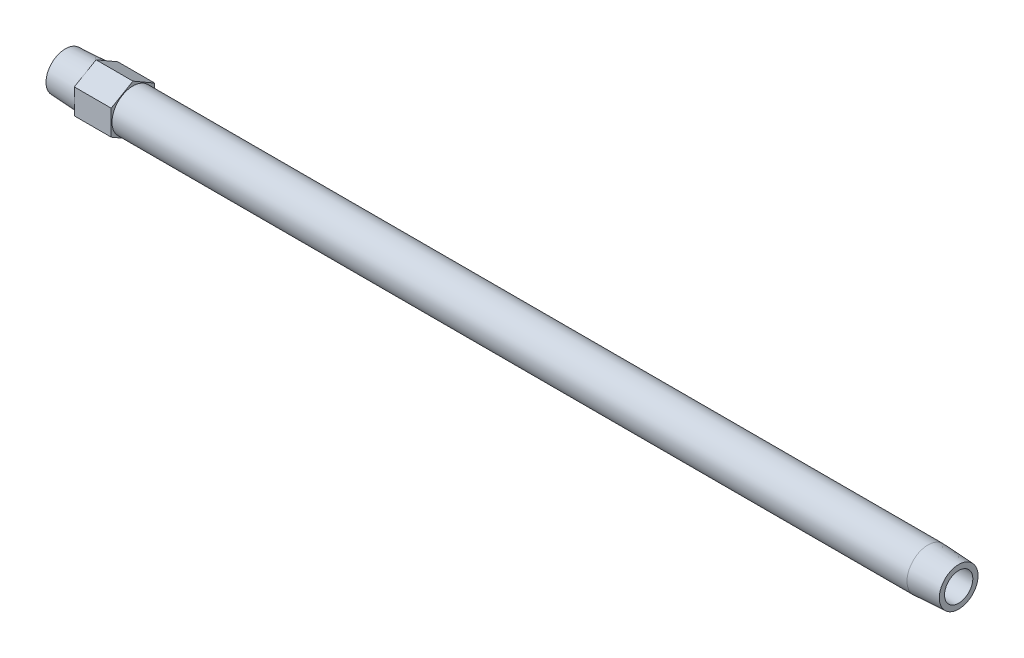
ISO-10303-21;
HEADER;
FILE_DESCRIPTION(('STEP AP214'),'2;1');
FILE_NAME('part.step','',(''),(''),'','','');
FILE_SCHEMA(('AUTOMOTIVE_DESIGN { 1 0 10303 214 1 1 1 1 }'));
ENDSEC;
DATA;
#1=APPLICATION_CONTEXT('core data for automotive mechanical design processes');
#2=APPLICATION_PROTOCOL_DEFINITION('international standard','automotive_design',2000,#1);
#3=PRODUCT_CONTEXT('',#1,'mechanical');
#4=PRODUCT('Part','Part','',(#3));
#5=PRODUCT_RELATED_PRODUCT_CATEGORY('part','',(#4));
#6=PRODUCT_DEFINITION_FORMATION('','',#4);
#7=PRODUCT_DEFINITION_CONTEXT('part definition',#1,'design');
#8=PRODUCT_DEFINITION('design','',#6,#7);
#9=PRODUCT_DEFINITION_SHAPE('','',#8);
#10=(LENGTH_UNIT() NAMED_UNIT(*) SI_UNIT(.MILLI.,.METRE.));
#11=(NAMED_UNIT(*) PLANE_ANGLE_UNIT() SI_UNIT($,.RADIAN.));
#12=(NAMED_UNIT(*) SI_UNIT($,.STERADIAN.) SOLID_ANGLE_UNIT());
#13=UNCERTAINTY_MEASURE_WITH_UNIT(LENGTH_MEASURE(1.E-05),#10,'distance_accuracy_value','');
#14=(GEOMETRIC_REPRESENTATION_CONTEXT(3) GLOBAL_UNCERTAINTY_ASSIGNED_CONTEXT((#13)) GLOBAL_UNIT_ASSIGNED_CONTEXT((#10,
#11,#12)) REPRESENTATION_CONTEXT('',''));
#15=CARTESIAN_POINT('',(0.,0.,0.));
#16=DIRECTION('',(0.,0.,1.));
#17=DIRECTION('',(1.,0.,0.));
#18=AXIS2_PLACEMENT_3D('',#15,#16,#17);
#19=CARTESIAN_POINT('',(0.,0.,-6.3321927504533));
#20=DIRECTION('',(1.,0.,0.));
#21=DIRECTION('',(0.,0.,-1.));
#22=AXIS2_PLACEMENT_3D('',#19,#20,#21);
#23=PLANE('',#22);
#24=CARTESIAN_POINT('',(0.,0.,0.));
#25=DIRECTION('',(-1.,0.,0.));
#26=DIRECTION('',(0.,0.,1.));
#27=AXIS2_PLACEMENT_3D('',#24,#25,#26);
#28=CIRCLE('',#27,6.3321927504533);
#29=CARTESIAN_POINT('',(0.,0.,6.3321927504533));
#30=VERTEX_POINT('',#29);
#31=EDGE_CURVE('E147',#30,#30,#28,.T.);
#32=ORIENTED_EDGE('',*,*,#31,.T.);
#33=EDGE_LOOP('',(#32));
#34=FACE_BOUND('',#33,.T.);
#35=CARTESIAN_POINT('',(0.,0.,0.));
#36=DIRECTION('',(1.,0.,0.));
#37=DIRECTION('',(0.,0.,1.));
#38=AXIS2_PLACEMENT_3D('',#35,#36,#37);
#39=CIRCLE('',#38,4.6228);
#40=CARTESIAN_POINT('',(0.,0.,4.6228));
#41=VERTEX_POINT('',#40);
#42=EDGE_CURVE('E159',#41,#41,#39,.T.);
#43=ORIENTED_EDGE('',*,*,#42,.T.);
#44=EDGE_LOOP('',(#43));
#45=FACE_BOUND('',#44,.T.);
#46=ADVANCED_FACE('F15',(#34,#45),#23,.F.);
#47=CARTESIAN_POINT('',(292.1,0.,-6.33219275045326));
#48=DIRECTION('',(-1.,0.,0.));
#49=DIRECTION('',(0.,0.,1.));
#50=AXIS2_PLACEMENT_3D('',#47,#48,#49);
#51=PLANE('',#50);
#52=CARTESIAN_POINT('',(292.1,0.,0.));
#53=DIRECTION('',(-1.,0.,0.));
#54=DIRECTION('',(0.,0.,1.));
#55=AXIS2_PLACEMENT_3D('',#52,#53,#54);
#56=CIRCLE('',#55,6.33219275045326);
#57=CARTESIAN_POINT('',(292.1,0.,6.33219275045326));
#58=VERTEX_POINT('',#57);
#59=EDGE_CURVE('E150',#58,#58,#56,.T.);
#60=ORIENTED_EDGE('',*,*,#59,.F.);
#61=EDGE_LOOP('',(#60));
#62=FACE_BOUND('',#61,.T.);
#63=CARTESIAN_POINT('',(292.1,0.,0.));
#64=DIRECTION('',(-1.,0.,0.));
#65=DIRECTION('',(0.,0.,1.));
#66=AXIS2_PLACEMENT_3D('',#63,#64,#65);
#67=CIRCLE('',#66,4.6228);
#68=CARTESIAN_POINT('',(292.1,0.,4.6228));
#69=VERTEX_POINT('',#68);
#70=EDGE_CURVE('E156',#69,#69,#67,.F.);
#71=ORIENTED_EDGE('',*,*,#70,.F.);
#72=EDGE_LOOP('',(#71));
#73=FACE_BOUND('',#72,.T.);
#74=ADVANCED_FACE('F178',(#62,#73),#51,.F.);
#75=CARTESIAN_POINT('',(22.098,-12.3183453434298,7.112));
#76=DIRECTION('',(-1.,0.,0.));
#77=DIRECTION('',(0.,-1.,0.));
#78=AXIS2_PLACEMENT_3D('',#75,#76,#77);
#79=PLANE('',#78);
#80=DIRECTION('',(0.,0.5,-0.866025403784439));
#81=VECTOR('',#80,1.);
#82=CARTESIAN_POINT('',(22.098,-8.21223022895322,0.));
#83=LINE('',#82,#81);
#84=CARTESIAN_POINT('',(22.098,-8.21223022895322,0.));
#85=VERTEX_POINT('',#84);
#86=CARTESIAN_POINT('',(22.098,-4.10611511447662,-7.112));
#87=VERTEX_POINT('',#86);
#88=EDGE_CURVE('E103',#85,#87,#83,.T.);
#89=ORIENTED_EDGE('',*,*,#88,.T.);
#90=DIRECTION('',(0.,1.,0.));
#91=VECTOR('',#90,1.);
#92=CARTESIAN_POINT('',(22.098,-4.10611511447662,-7.112));
#93=LINE('',#92,#91);
#94=CARTESIAN_POINT('',(22.098,4.10611511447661,-7.112));
#95=VERTEX_POINT('',#94);
#96=EDGE_CURVE('E83',#87,#95,#93,.T.);
#97=ORIENTED_EDGE('',*,*,#96,.T.);
#98=DIRECTION('',(0.,0.5,0.866025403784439));
#99=VECTOR('',#98,1.);
#100=CARTESIAN_POINT('',(22.098,4.10611511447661,-7.112));
#101=LINE('',#100,#99);
#102=CARTESIAN_POINT('',(22.098,8.21223022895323,0.));
#103=VERTEX_POINT('',#102);
#104=EDGE_CURVE('E102',#95,#103,#101,.T.);
#105=ORIENTED_EDGE('',*,*,#104,.T.);
#106=DIRECTION('',(0.,-0.5,0.866025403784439));
#107=VECTOR('',#106,1.);
#108=CARTESIAN_POINT('',(22.098,8.21223022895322,0.));
#109=LINE('',#108,#107);
#110=CARTESIAN_POINT('',(22.098,4.10611511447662,7.112));
#111=VERTEX_POINT('',#110);
#112=EDGE_CURVE('E105',#103,#111,#109,.T.);
#113=ORIENTED_EDGE('',*,*,#112,.T.);
#114=DIRECTION('',(0.,-1.,0.));
#115=VECTOR('',#114,1.);
#116=CARTESIAN_POINT('',(22.098,4.10611511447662,7.112));
#117=LINE('',#116,#115);
#118=CARTESIAN_POINT('',(22.098,-4.10611511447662,7.112));
#119=VERTEX_POINT('',#118);
#120=EDGE_CURVE('E35',#111,#119,#117,.T.);
#121=ORIENTED_EDGE('',*,*,#120,.T.);
#122=DIRECTION('',(0.,-0.5,-0.866025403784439));
#123=VECTOR('',#122,1.);
#124=CARTESIAN_POINT('',(22.098,-4.10611511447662,7.112));
#125=LINE('',#124,#123);
#126=EDGE_CURVE('E30',#119,#85,#125,.T.);
#127=ORIENTED_EDGE('',*,*,#126,.T.);
#128=EDGE_LOOP('',(#89,#97,#105,#113,#121,#127));
#129=FACE_BOUND('',#128,.T.);
#130=CARTESIAN_POINT('',(22.098,0.,0.));
#131=DIRECTION('',(-1.,0.,0.));
#132=DIRECTION('',(0.,-1.,0.));
#133=AXIS2_PLACEMENT_3D('',#130,#131,#132);
#134=CIRCLE('',#133,6.858);
#135=CARTESIAN_POINT('',(22.098,-6.858,0.));
#136=VERTEX_POINT('',#135);
#137=EDGE_CURVE('E89',#136,#136,#134,.F.);
#138=ORIENTED_EDGE('',*,*,#137,.F.);
#139=EDGE_LOOP('',(#138));
#140=FACE_BOUND('',#139,.T.);
#141=ADVANCED_FACE('F124',(#129,#140),#79,.F.);
#142=CARTESIAN_POINT('',(10.033,-12.3183453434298,7.112));
#143=DIRECTION('',(-1.,0.,0.));
#144=DIRECTION('',(0.,-1.,0.));
#145=AXIS2_PLACEMENT_3D('',#142,#143,#144);
#146=PLANE('',#145);
#147=DIRECTION('',(0.,0.5,-0.866025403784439));
#148=VECTOR('',#147,1.);
#149=CARTESIAN_POINT('',(10.033,-8.21223022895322,0.));
#150=LINE('',#149,#148);
#151=CARTESIAN_POINT('',(10.033,-8.21223022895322,0.));
#152=VERTEX_POINT('',#151);
#153=CARTESIAN_POINT('',(10.033,-4.10611511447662,-7.112));
#154=VERTEX_POINT('',#153);
#155=EDGE_CURVE('E73',#152,#154,#150,.T.);
#156=ORIENTED_EDGE('',*,*,#155,.F.);
#157=DIRECTION('',(0.,-0.5,-0.866025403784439));
#158=VECTOR('',#157,1.);
#159=CARTESIAN_POINT('',(10.033,-4.10611511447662,7.112));
#160=LINE('',#159,#158);
#161=CARTESIAN_POINT('',(10.033,-4.10611511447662,7.112));
#162=VERTEX_POINT('',#161);
#163=EDGE_CURVE('E99',#162,#152,#160,.T.);
#164=ORIENTED_EDGE('',*,*,#163,.F.);
#165=DIRECTION('',(0.,-1.,0.));
#166=VECTOR('',#165,1.);
#167=CARTESIAN_POINT('',(10.033,4.10611511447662,7.112));
#168=LINE('',#167,#166);
#169=CARTESIAN_POINT('',(10.033,4.10611511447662,7.112));
#170=VERTEX_POINT('',#169);
#171=EDGE_CURVE('E133',#170,#162,#168,.T.);
#172=ORIENTED_EDGE('',*,*,#171,.F.);
#173=DIRECTION('',(0.,-0.5,0.866025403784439));
#174=VECTOR('',#173,1.);
#175=CARTESIAN_POINT('',(10.033,8.21223022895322,0.));
#176=LINE('',#175,#174);
#177=CARTESIAN_POINT('',(10.033,8.21223022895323,0.));
#178=VERTEX_POINT('',#177);
#179=EDGE_CURVE('E129',#178,#170,#176,.T.);
#180=ORIENTED_EDGE('',*,*,#179,.F.);
#181=DIRECTION('',(0.,0.5,0.866025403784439));
#182=VECTOR('',#181,1.);
#183=CARTESIAN_POINT('',(10.033,4.10611511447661,-7.112));
#184=LINE('',#183,#182);
#185=CARTESIAN_POINT('',(10.033,4.10611511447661,-7.112));
#186=VERTEX_POINT('',#185);
#187=EDGE_CURVE('E75',#186,#178,#184,.T.);
#188=ORIENTED_EDGE('',*,*,#187,.F.);
#189=DIRECTION('',(0.,1.,0.));
#190=VECTOR('',#189,1.);
#191=CARTESIAN_POINT('',(10.033,-4.10611511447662,-7.112));
#192=LINE('',#191,#190);
#193=EDGE_CURVE('E68',#154,#186,#192,.T.);
#194=ORIENTED_EDGE('',*,*,#193,.F.);
#195=EDGE_LOOP('',(#156,#164,#172,#180,#188,#194));
#196=FACE_BOUND('',#195,.T.);
#197=CARTESIAN_POINT('',(10.033,0.,0.));
#198=DIRECTION('',(-1.,0.,0.));
#199=DIRECTION('',(0.,0.,1.));
#200=AXIS2_PLACEMENT_3D('',#197,#198,#199);
#201=CIRCLE('',#200,6.858);
#202=CARTESIAN_POINT('',(10.033,0.,6.858));
#203=VERTEX_POINT('',#202);
#204=EDGE_CURVE('E95',#203,#203,#201,.T.);
#205=ORIENTED_EDGE('',*,*,#204,.F.);
#206=EDGE_LOOP('',(#205));
#207=FACE_BOUND('',#206,.T.);
#208=ADVANCED_FACE('F69',(#196,#207),#146,.T.);
#209=CARTESIAN_POINT('',(22.098,-8.21223022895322,0.));
#210=DIRECTION('',(0.,0.866025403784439,0.5));
#211=DIRECTION('',(0.,-0.5,0.866025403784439));
#212=AXIS2_PLACEMENT_3D('',#209,#210,#211);
#213=PLANE('',#212);
#214=ORIENTED_EDGE('',*,*,#155,.T.);
#215=DIRECTION('',(-1.,0.,0.));
#216=VECTOR('',#215,1.);
#217=CARTESIAN_POINT('',(22.098,-4.10611511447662,-7.112));
#218=LINE('',#217,#216);
#219=EDGE_CURVE('E10',#87,#154,#218,.T.);
#220=ORIENTED_EDGE('',*,*,#219,.F.);
#221=ORIENTED_EDGE('',*,*,#88,.F.);
#222=DIRECTION('',(-1.,0.,0.));
#223=VECTOR('',#222,1.);
#224=CARTESIAN_POINT('',(22.098,-8.21223022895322,0.));
#225=LINE('',#224,#223);
#226=EDGE_CURVE('E87',#85,#152,#225,.T.);
#227=ORIENTED_EDGE('',*,*,#226,.T.);
#228=EDGE_LOOP('',(#214,#220,#221,#227));
#229=FACE_BOUND('',#228,.T.);
#230=ADVANCED_FACE('F17',(#229),#213,.F.);
#231=CARTESIAN_POINT('',(22.098,-4.10611511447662,-7.112));
#232=DIRECTION('',(0.,0.,1.));
#233=DIRECTION('',(0.,-1.,0.));
#234=AXIS2_PLACEMENT_3D('',#231,#232,#233);
#235=PLANE('',#234);
#236=ORIENTED_EDGE('',*,*,#193,.T.);
#237=DIRECTION('',(-1.,0.,0.));
#238=VECTOR('',#237,1.);
#239=CARTESIAN_POINT('',(22.098,4.10611511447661,-7.112));
#240=LINE('',#239,#238);
#241=EDGE_CURVE('E23',#95,#186,#240,.T.);
#242=ORIENTED_EDGE('',*,*,#241,.F.);
#243=ORIENTED_EDGE('',*,*,#96,.F.);
#244=ORIENTED_EDGE('',*,*,#219,.T.);
#245=EDGE_LOOP('',(#236,#242,#243,#244));
#246=FACE_BOUND('',#245,.T.);
#247=ADVANCED_FACE('F82',(#246),#235,.F.);
#248=CARTESIAN_POINT('',(22.098,4.10611511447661,-7.112));
#249=DIRECTION('',(0.,-0.866025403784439,0.5));
#250=DIRECTION('',(0.,-0.5,-0.866025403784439));
#251=AXIS2_PLACEMENT_3D('',#248,#249,#250);
#252=PLANE('',#251);
#253=ORIENTED_EDGE('',*,*,#187,.T.);
#254=DIRECTION('',(-1.,0.,0.));
#255=VECTOR('',#254,1.);
#256=CARTESIAN_POINT('',(22.098,8.21223022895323,0.));
#257=LINE('',#256,#255);
#258=EDGE_CURVE('E117',#103,#178,#257,.T.);
#259=ORIENTED_EDGE('',*,*,#258,.F.);
#260=ORIENTED_EDGE('',*,*,#104,.F.);
#261=ORIENTED_EDGE('',*,*,#241,.T.);
#262=EDGE_LOOP('',(#253,#259,#260,#261));
#263=FACE_BOUND('',#262,.T.);
#264=ADVANCED_FACE('F121',(#263),#252,.F.);
#265=CARTESIAN_POINT('',(22.098,8.21223022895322,0.));
#266=DIRECTION('',(0.,-0.866025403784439,-0.5));
#267=DIRECTION('',(0.,0.5,-0.866025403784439));
#268=AXIS2_PLACEMENT_3D('',#265,#266,#267);
#269=PLANE('',#268);
#270=ORIENTED_EDGE('',*,*,#179,.T.);
#271=DIRECTION('',(-1.,0.,0.));
#272=VECTOR('',#271,1.);
#273=CARTESIAN_POINT('',(22.098,4.10611511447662,7.112));
#274=LINE('',#273,#272);
#275=EDGE_CURVE('E114',#111,#170,#274,.T.);
#276=ORIENTED_EDGE('',*,*,#275,.F.);
#277=ORIENTED_EDGE('',*,*,#112,.F.);
#278=ORIENTED_EDGE('',*,*,#258,.T.);
#279=EDGE_LOOP('',(#270,#276,#277,#278));
#280=FACE_BOUND('',#279,.T.);
#281=ADVANCED_FACE('F128',(#280),#269,.F.);
#282=CARTESIAN_POINT('',(22.098,4.10611511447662,7.112));
#283=DIRECTION('',(0.,0.,-1.));
#284=DIRECTION('',(-1.,0.,0.));
#285=AXIS2_PLACEMENT_3D('',#282,#283,#284);
#286=PLANE('',#285);
#287=ORIENTED_EDGE('',*,*,#171,.T.);
#288=DIRECTION('',(-1.,0.,0.));
#289=VECTOR('',#288,1.);
#290=CARTESIAN_POINT('',(22.098,-4.10611511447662,7.112));
#291=LINE('',#290,#289);
#292=EDGE_CURVE('E111',#119,#162,#291,.T.);
#293=ORIENTED_EDGE('',*,*,#292,.F.);
#294=ORIENTED_EDGE('',*,*,#120,.F.);
#295=ORIENTED_EDGE('',*,*,#275,.T.);
#296=EDGE_LOOP('',(#287,#293,#294,#295));
#297=FACE_BOUND('',#296,.T.);
#298=ADVANCED_FACE('F132',(#297),#286,.F.);
#299=CARTESIAN_POINT('',(22.098,-4.10611511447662,7.112));
#300=DIRECTION('',(0.,0.866025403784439,-0.5));
#301=DIRECTION('',(0.,0.5,0.866025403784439));
#302=AXIS2_PLACEMENT_3D('',#299,#300,#301);
#303=PLANE('',#302);
#304=ORIENTED_EDGE('',*,*,#163,.T.);
#305=ORIENTED_EDGE('',*,*,#226,.F.);
#306=ORIENTED_EDGE('',*,*,#126,.F.);
#307=ORIENTED_EDGE('',*,*,#292,.T.);
#308=EDGE_LOOP('',(#304,#305,#306,#307));
#309=FACE_BOUND('',#308,.T.);
#310=ADVANCED_FACE('F135',(#309),#303,.F.);
#311=CARTESIAN_POINT('',(10.033,0.,0.));
#312=DIRECTION('',(1.,0.,0.));
#313=DIRECTION('',(0.,0.,-1.));
#314=AXIS2_PLACEMENT_3D('',#311,#312,#313);
#315=CONICAL_SURFACE('',#314,6.858,0.0523598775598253);
#316=ORIENTED_EDGE('',*,*,#31,.F.);
#317=EDGE_LOOP('',(#316));
#318=FACE_BOUND('',#317,.T.);
#319=ORIENTED_EDGE('',*,*,#204,.T.);
#320=EDGE_LOOP('',(#319));
#321=FACE_BOUND('',#320,.T.);
#322=ADVANCED_FACE('F187',(#318,#321),#315,.T.);
#323=CARTESIAN_POINT('',(-60.,0.,0.));
#324=DIRECTION('',(-1.,0.,0.));
#325=DIRECTION('',(0.,0.,1.));
#326=AXIS2_PLACEMENT_3D('',#323,#324,#325);
#327=CYLINDRICAL_SURFACE('',#326,6.858);
#328=ORIENTED_EDGE('',*,*,#137,.T.);
#329=EDGE_LOOP('',(#328));
#330=FACE_BOUND('',#329,.T.);
#331=CARTESIAN_POINT('',(282.067,0.,0.));
#332=DIRECTION('',(-1.,0.,0.));
#333=DIRECTION('',(0.,0.,1.));
#334=AXIS2_PLACEMENT_3D('',#331,#332,#333);
#335=CIRCLE('',#334,6.858);
#336=CARTESIAN_POINT('',(282.067,0.,6.858));
#337=VERTEX_POINT('',#336);
#338=EDGE_CURVE('E153',#337,#337,#335,.T.);
#339=ORIENTED_EDGE('',*,*,#338,.T.);
#340=EDGE_LOOP('',(#339));
#341=FACE_BOUND('',#340,.T.);
#342=ADVANCED_FACE('F174',(#330,#341),#327,.T.);
#343=CARTESIAN_POINT('',(292.1,0.,0.));
#344=DIRECTION('',(-1.,0.,0.));
#345=DIRECTION('',(0.,0.,1.));
#346=AXIS2_PLACEMENT_3D('',#343,#344,#345);
#347=CONICAL_SURFACE('',#346,6.33219275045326,0.0523598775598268);
#348=ORIENTED_EDGE('',*,*,#338,.F.);
#349=EDGE_LOOP('',(#348));
#350=FACE_BOUND('',#349,.T.);
#351=ORIENTED_EDGE('',*,*,#59,.T.);
#352=EDGE_LOOP('',(#351));
#353=FACE_BOUND('',#352,.T.);
#354=ADVANCED_FACE('F167',(#350,#353),#347,.T.);
#355=CARTESIAN_POINT('',(292.906973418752,0.,0.));
#356=DIRECTION('',(-1.,0.,0.));
#357=DIRECTION('',(0.,0.,1.));
#358=AXIS2_PLACEMENT_3D('',#355,#356,#357);
#359=CYLINDRICAL_SURFACE('',#358,4.6228);
#360=ORIENTED_EDGE('',*,*,#70,.T.);
#361=EDGE_LOOP('',(#360));
#362=FACE_BOUND('',#361,.T.);
#363=ORIENTED_EDGE('',*,*,#42,.F.);
#364=EDGE_LOOP('',(#363));
#365=FACE_BOUND('',#364,.T.);
#366=ADVANCED_FACE('F165',(#362,#365),#359,.F.);
#367=CLOSED_SHELL('',(#46,#74,#141,#208,#230,#247,#264,#281,#298,#310,#322,#342,#354,#366));
#368=MANIFOLD_SOLID_BREP('B1',#367);
#369=ADVANCED_BREP_SHAPE_REPRESENTATION('',(#18,#368),#14);
#370=SHAPE_DEFINITION_REPRESENTATION(#9,#369);
ENDSEC;
END-ISO-10303-21;
